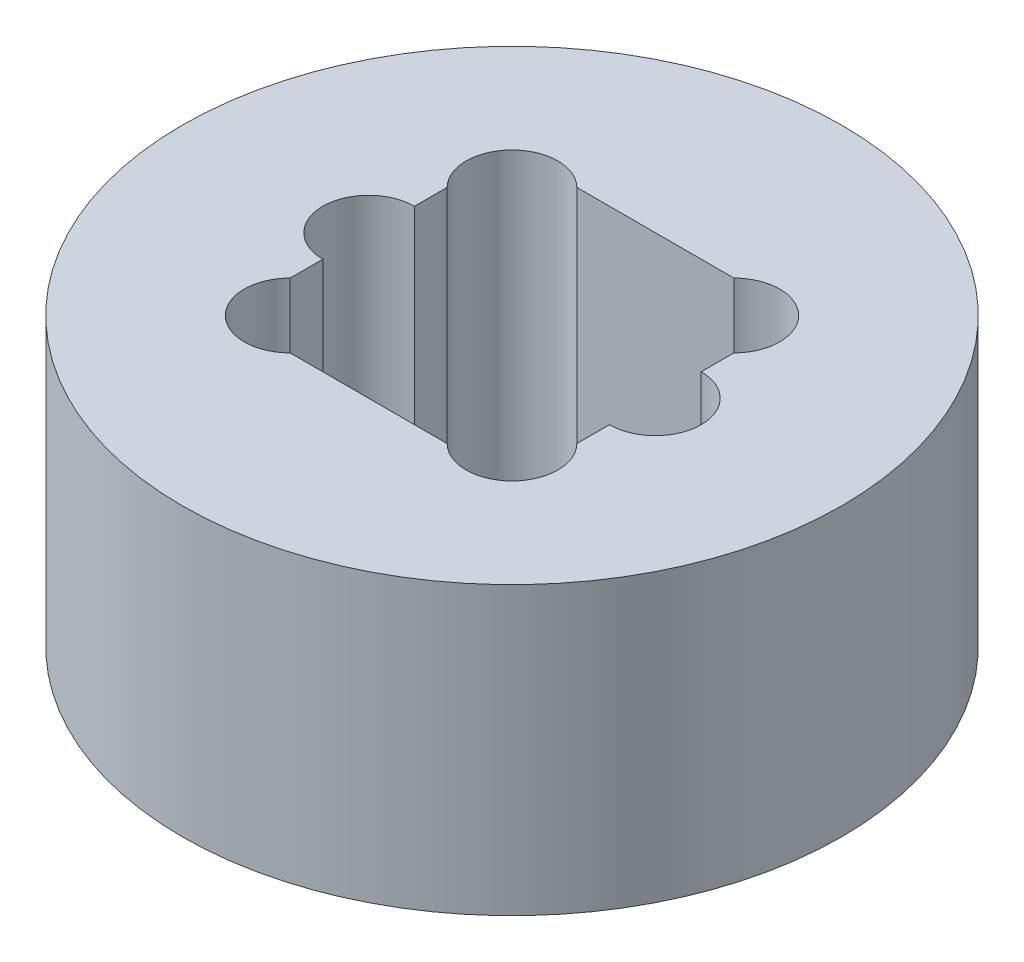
from build123d import *

# Parameters (mm, degrees)
ESQUISSE1_R             = 11.5
BOSS_EXTRU_1_DEPTH      = 10
ENL_V_MAT_EXTRU_1_DEPTH = 20.091883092
ESQUISSE4_R             = 1.6
ENL_V_MAT_EXTRU_2_DEPTH = 10


with BuildPart() as part:
    # Esquisse1 → Boss.-Extru.1 (new body)
    with BuildSketch(Plane(origin=(0, 0, 0), x_dir=(1, 0, 0), z_dir=(0, 1, 0))):
        with Locations(Location((0, 0, 0), (0, 0, 270))):
            Circle(ESQUISSE1_R)
    extrude(amount=BOSS_EXTRU_1_DEPTH)

    # Esquisse3 → Enl_v. mat.-Extru.1 (cut, through all)
    with BuildSketch(Plane(origin=(0, 10, 0), x_dir=(1, 0, 0), z_dir=(0, 1, 0))):
        with BuildLine():
            Line((-2.7372583, -5), (2.7372583, -5))
            ThreePointArc((2.7372583, -5), (5, -5), (5, -2.7372583))
            Line((5, -2.7372583), (5, 2.7372583))
            ThreePointArc((5, 2.7372583), (5, 5), (2.7372583, 5))
            Line((2.7372583, 5), (-2.7372583, 5))
            ThreePointArc((-2.7372583, 5), (-5, 5), (-5, 2.7372583))
            Line((-5, 2.7372583), (-5, -2.7372583))
            ThreePointArc((-5, -2.7372583), (-5, -5), (-2.7372583, -5))
        make_face()
    extrude(amount=-ENL_V_MAT_EXTRU_1_DEPTH, mode=Mode.SUBTRACT)

    # Esquisse4 → Enl_v. mat.-Extru.2 (cut)
    with BuildSketch(Plane(origin=(0, 0, 0), x_dir=(-1, 0, 0), z_dir=(0, -1, 0))):
        with Locations((5, 0)):
            Circle(ESQUISSE4_R)
        with Locations((-5, 0)):
            Circle(ESQUISSE4_R)
    extrude(amount=-ENL_V_MAT_EXTRU_2_DEPTH, mode=Mode.SUBTRACT)


solid = part.part
